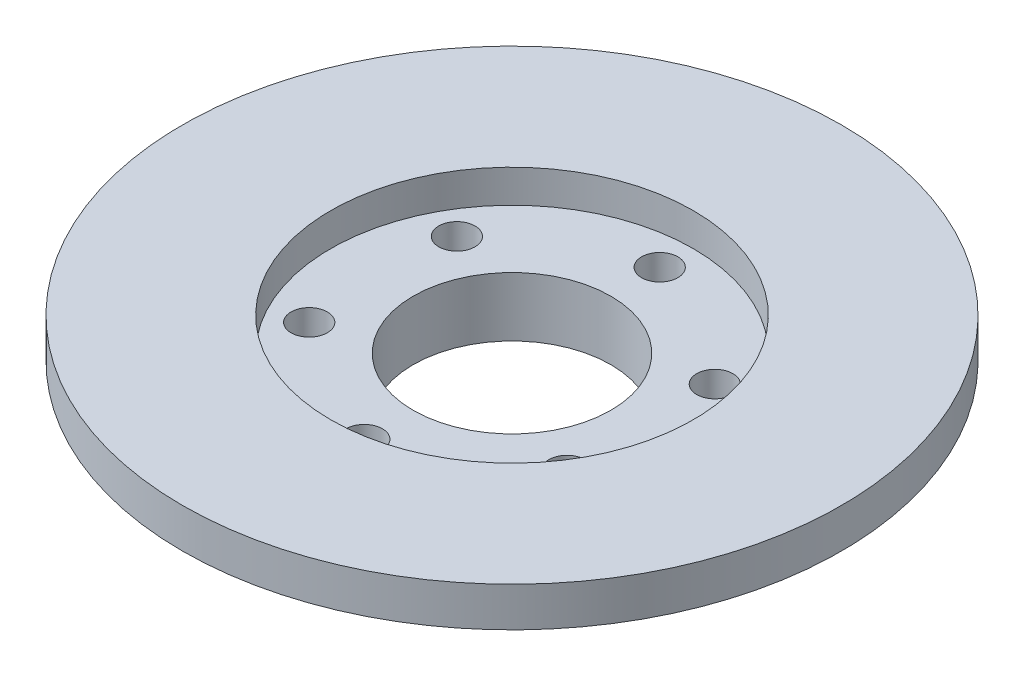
ISO-10303-21;
HEADER;
FILE_DESCRIPTION(('STEP AP214'),'2;1');
FILE_NAME('part.step','',(''),(''),'','','');
FILE_SCHEMA(('AUTOMOTIVE_DESIGN { 1 0 10303 214 1 1 1 1 }'));
ENDSEC;
DATA;
#1=APPLICATION_CONTEXT('core data for automotive mechanical design processes');
#2=APPLICATION_PROTOCOL_DEFINITION('international standard','automotive_design',2000,#1);
#3=PRODUCT_CONTEXT('',#1,'mechanical');
#4=PRODUCT('Part','Part','',(#3));
#5=PRODUCT_RELATED_PRODUCT_CATEGORY('part','',(#4));
#6=PRODUCT_DEFINITION_FORMATION('','',#4);
#7=PRODUCT_DEFINITION_CONTEXT('part definition',#1,'design');
#8=PRODUCT_DEFINITION('design','',#6,#7);
#9=PRODUCT_DEFINITION_SHAPE('','',#8);
#10=(LENGTH_UNIT() NAMED_UNIT(*) SI_UNIT(.MILLI.,.METRE.));
#11=(NAMED_UNIT(*) PLANE_ANGLE_UNIT() SI_UNIT($,.RADIAN.));
#12=(NAMED_UNIT(*) SI_UNIT($,.STERADIAN.) SOLID_ANGLE_UNIT());
#13=UNCERTAINTY_MEASURE_WITH_UNIT(LENGTH_MEASURE(1.E-05),#10,'distance_accuracy_value','');
#14=(GEOMETRIC_REPRESENTATION_CONTEXT(3) GLOBAL_UNCERTAINTY_ASSIGNED_CONTEXT((#13)) GLOBAL_UNIT_ASSIGNED_CONTEXT((#10,
#11,#12)) REPRESENTATION_CONTEXT('',''));
#15=CARTESIAN_POINT('',(0.,0.,0.));
#16=DIRECTION('',(0.,0.,1.));
#17=DIRECTION('',(1.,0.,0.));
#18=AXIS2_PLACEMENT_3D('',#15,#16,#17);
#19=CARTESIAN_POINT('',(0.779944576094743,-12.1504176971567,0.));
#20=DIRECTION('',(0.,-1.,0.));
#21=DIRECTION('',(0.,0.,-1.));
#22=AXIS2_PLACEMENT_3D('',#19,#20,#21);
#23=PLANE('',#22);
#24=CARTESIAN_POINT('',(-49.2200554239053,-12.1504176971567,0.));
#25=DIRECTION('',(0.,-1.,0.));
#26=DIRECTION('',(0.,0.,-1.));
#27=AXIS2_PLACEMENT_3D('',#24,#25,#26);
#28=CIRCLE('',#27,30.);
#29=CARTESIAN_POINT('',(-49.2200554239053,-12.1504176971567,-30.));
#30=VERTEX_POINT('',#29);
#31=EDGE_CURVE('E59',#30,#30,#28,.F.);
#32=ORIENTED_EDGE('',*,*,#31,.T.);
#33=EDGE_LOOP('',(#32));
#34=FACE_BOUND('',#33,.T.);
#35=CARTESIAN_POINT('',(-49.4013346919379,-12.1504176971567,-45.));
#36=DIRECTION('',(0.,-1.,0.));
#37=DIRECTION('',(0.,0.,-1.));
#38=AXIS2_PLACEMENT_3D('',#35,#36,#37);
#39=CIRCLE('',#38,5.5);
#40=CARTESIAN_POINT('',(-49.4013346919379,-12.1504176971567,-50.5));
#41=VERTEX_POINT('',#40);
#42=EDGE_CURVE('E62',#41,#41,#39,.F.);
#43=ORIENTED_EDGE('',*,*,#42,.T.);
#44=EDGE_LOOP('',(#43));
#45=FACE_BOUND('',#44,.T.);
#46=CARTESIAN_POINT('',(-88.2818382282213,-12.1504176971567,-22.3430075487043));
#47=DIRECTION('',(0.,-1.,0.));
#48=DIRECTION('',(0.,0.,-1.));
#49=AXIS2_PLACEMENT_3D('',#46,#47,#48);
#50=CIRCLE('',#49,5.50000000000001);
#51=CARTESIAN_POINT('',(-88.2818382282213,-12.1504176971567,-27.8430075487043));
#52=VERTEX_POINT('',#51);
#53=EDGE_CURVE('E65',#52,#52,#50,.F.);
#54=ORIENTED_EDGE('',*,*,#53,.T.);
#55=EDGE_LOOP('',(#54));
#56=FACE_BOUND('',#55,.T.);
#57=CARTESIAN_POINT('',(-10.3395518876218,-12.1504176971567,-22.6569924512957));
#58=DIRECTION('',(0.,-1.,0.));
#59=DIRECTION('',(1.,0.,0.));
#60=AXIS2_PLACEMENT_3D('',#57,#58,#59);
#61=CIRCLE('',#60,5.5);
#62=CARTESIAN_POINT('',(-4.83955188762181,-12.1504176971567,-22.6569924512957));
#63=VERTEX_POINT('',#62);
#64=EDGE_CURVE('E68',#63,#63,#61,.F.);
#65=ORIENTED_EDGE('',*,*,#64,.T.);
#66=EDGE_LOOP('',(#65));
#67=FACE_BOUND('',#66,.T.);
#68=CARTESIAN_POINT('',(-10.1582726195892,-12.1504176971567,22.3430075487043));
#69=DIRECTION('',(0.,-1.,0.));
#70=DIRECTION('',(0.,0.,-1.));
#71=AXIS2_PLACEMENT_3D('',#68,#69,#70);
#72=CIRCLE('',#71,5.5);
#73=CARTESIAN_POINT('',(-10.1582726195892,-12.1504176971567,16.8430075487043));
#74=VERTEX_POINT('',#73);
#75=EDGE_CURVE('E71',#74,#74,#72,.F.);
#76=ORIENTED_EDGE('',*,*,#75,.T.);
#77=EDGE_LOOP('',(#76));
#78=FACE_BOUND('',#77,.T.);
#79=CARTESIAN_POINT('',(-49.0387761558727,-12.1504176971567,45.));
#80=DIRECTION('',(0.,-1.,0.));
#81=DIRECTION('',(0.,0.,-1.));
#82=AXIS2_PLACEMENT_3D('',#79,#80,#81);
#83=CIRCLE('',#82,5.5);
#84=CARTESIAN_POINT('',(-49.0387761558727,-12.1504176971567,39.5));
#85=VERTEX_POINT('',#84);
#86=EDGE_CURVE('E74',#85,#85,#83,.F.);
#87=ORIENTED_EDGE('',*,*,#86,.T.);
#88=EDGE_LOOP('',(#87));
#89=FACE_BOUND('',#88,.T.);
#90=CARTESIAN_POINT('',(-88.1005589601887,-12.1504176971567,22.6569924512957));
#91=DIRECTION('',(0.,-1.,0.));
#92=DIRECTION('',(1.,0.,0.));
#93=AXIS2_PLACEMENT_3D('',#90,#91,#92);
#94=CIRCLE('',#93,5.5);
#95=CARTESIAN_POINT('',(-82.6005589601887,-12.1504176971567,22.6569924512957));
#96=VERTEX_POINT('',#95);
#97=EDGE_CURVE('E76',#96,#96,#94,.F.);
#98=ORIENTED_EDGE('',*,*,#97,.T.);
#99=EDGE_LOOP('',(#98));
#100=FACE_BOUND('',#99,.T.);
#101=CARTESIAN_POINT('',(-49.2200554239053,-12.1504176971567,0.));
#102=DIRECTION('',(0.,-1.,0.));
#103=DIRECTION('',(0.,0.,-1.));
#104=AXIS2_PLACEMENT_3D('',#101,#102,#103);
#105=CIRCLE('',#104,70.);
#106=CARTESIAN_POINT('',(-49.2200554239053,-12.1504176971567,-70.));
#107=VERTEX_POINT('',#106);
#108=EDGE_CURVE('E18',#107,#107,#105,.F.);
#109=ORIENTED_EDGE('',*,*,#108,.F.);
#110=EDGE_LOOP('',(#109));
#111=FACE_BOUND('',#110,.T.);
#112=ADVANCED_FACE('F14',(#34,#45,#56,#67,#78,#89,#100,#111),#23,.T.);
#113=CARTESIAN_POINT('',(-49.2200554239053,-4.15041769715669,0.));
#114=DIRECTION('',(0.,-1.,0.));
#115=DIRECTION('',(0.,0.,-1.));
#116=AXIS2_PLACEMENT_3D('',#113,#114,#115);
#117=CYLINDRICAL_SURFACE('',#116,70.);
#118=ORIENTED_EDGE('',*,*,#108,.T.);
#119=EDGE_LOOP('',(#118));
#120=FACE_BOUND('',#119,.T.);
#121=CARTESIAN_POINT('',(-49.2200554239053,3.84958230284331,0.));
#122=DIRECTION('',(0.,-1.,0.));
#123=DIRECTION('',(0.,0.,-1.));
#124=AXIS2_PLACEMENT_3D('',#121,#122,#123);
#125=CIRCLE('',#124,70.);
#126=CARTESIAN_POINT('',(-49.2200554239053,3.84958230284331,-70.));
#127=VERTEX_POINT('',#126);
#128=EDGE_CURVE('E56',#127,#127,#125,.F.);
#129=ORIENTED_EDGE('',*,*,#128,.F.);
#130=EDGE_LOOP('',(#129));
#131=FACE_BOUND('',#130,.T.);
#132=ADVANCED_FACE('F83',(#120,#131),#117,.T.);
#133=CARTESIAN_POINT('',(-88.1005589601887,5.84958230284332,22.6569924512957));
#134=DIRECTION('',(0.,-1.,0.));
#135=DIRECTION('',(1.,0.,0.));
#136=AXIS2_PLACEMENT_3D('',#133,#134,#135);
#137=CYLINDRICAL_SURFACE('',#136,5.5);
#138=CARTESIAN_POINT('',(-88.1005589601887,5.8495823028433,22.6569924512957));
#139=DIRECTION('',(0.,-1.,0.));
#140=DIRECTION('',(1.,0.,0.));
#141=AXIS2_PLACEMENT_3D('',#138,#139,#140);
#142=CIRCLE('',#141,5.5);
#143=CARTESIAN_POINT('',(-82.6005589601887,5.8495823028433,22.6569924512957));
#144=VERTEX_POINT('',#143);
#145=EDGE_CURVE('E53',#144,#144,#142,.T.);
#146=ORIENTED_EDGE('',*,*,#145,.F.);
#147=EDGE_LOOP('',(#146));
#148=FACE_BOUND('',#147,.T.);
#149=ORIENTED_EDGE('',*,*,#97,.F.);
#150=EDGE_LOOP('',(#149));
#151=FACE_BOUND('',#150,.T.);
#152=ADVANCED_FACE('F92',(#148,#151),#137,.F.);
#153=CARTESIAN_POINT('',(-49.0387761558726,5.84958230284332,45.));
#154=DIRECTION('',(0.,-1.,0.));
#155=DIRECTION('',(0.,0.,-1.));
#156=AXIS2_PLACEMENT_3D('',#153,#154,#155);
#157=CYLINDRICAL_SURFACE('',#156,5.5);
#158=CARTESIAN_POINT('',(-49.0387761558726,5.8495823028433,45.));
#159=DIRECTION('',(0.,-1.,0.));
#160=DIRECTION('',(0.,0.,-1.));
#161=AXIS2_PLACEMENT_3D('',#158,#159,#160);
#162=CIRCLE('',#161,5.5);
#163=CARTESIAN_POINT('',(-49.0387761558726,5.8495823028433,39.5));
#164=VERTEX_POINT('',#163);
#165=EDGE_CURVE('E50',#164,#164,#162,.T.);
#166=ORIENTED_EDGE('',*,*,#165,.F.);
#167=EDGE_LOOP('',(#166));
#168=FACE_BOUND('',#167,.T.);
#169=ORIENTED_EDGE('',*,*,#86,.F.);
#170=EDGE_LOOP('',(#169));
#171=FACE_BOUND('',#170,.T.);
#172=ADVANCED_FACE('F109',(#168,#171),#157,.F.);
#173=CARTESIAN_POINT('',(-10.1582726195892,5.84958230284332,22.3430075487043));
#174=DIRECTION('',(0.,-1.,0.));
#175=DIRECTION('',(0.,0.,-1.));
#176=AXIS2_PLACEMENT_3D('',#173,#174,#175);
#177=CYLINDRICAL_SURFACE('',#176,5.5);
#178=CARTESIAN_POINT('',(-10.1582726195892,5.8495823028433,22.3430075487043));
#179=DIRECTION('',(0.,-1.,0.));
#180=DIRECTION('',(0.,0.,-1.));
#181=AXIS2_PLACEMENT_3D('',#178,#179,#180);
#182=CIRCLE('',#181,5.5);
#183=CARTESIAN_POINT('',(-10.1582726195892,5.8495823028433,16.8430075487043));
#184=VERTEX_POINT('',#183);
#185=EDGE_CURVE('E47',#184,#184,#182,.T.);
#186=ORIENTED_EDGE('',*,*,#185,.F.);
#187=EDGE_LOOP('',(#186));
#188=FACE_BOUND('',#187,.T.);
#189=ORIENTED_EDGE('',*,*,#75,.F.);
#190=EDGE_LOOP('',(#189));
#191=FACE_BOUND('',#190,.T.);
#192=ADVANCED_FACE('F113',(#188,#191),#177,.F.);
#193=CARTESIAN_POINT('',(-10.3395518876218,5.84958230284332,-22.6569924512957));
#194=DIRECTION('',(0.,-1.,0.));
#195=DIRECTION('',(1.,0.,0.));
#196=AXIS2_PLACEMENT_3D('',#193,#194,#195);
#197=CYLINDRICAL_SURFACE('',#196,5.5);
#198=CARTESIAN_POINT('',(-10.3395518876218,5.8495823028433,-22.6569924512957));
#199=DIRECTION('',(0.,-1.,0.));
#200=DIRECTION('',(1.,0.,0.));
#201=AXIS2_PLACEMENT_3D('',#198,#199,#200);
#202=CIRCLE('',#201,5.5);
#203=CARTESIAN_POINT('',(-4.83955188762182,5.8495823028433,-22.6569924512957));
#204=VERTEX_POINT('',#203);
#205=EDGE_CURVE('E44',#204,#204,#202,.T.);
#206=ORIENTED_EDGE('',*,*,#205,.F.);
#207=EDGE_LOOP('',(#206));
#208=FACE_BOUND('',#207,.T.);
#209=ORIENTED_EDGE('',*,*,#64,.F.);
#210=EDGE_LOOP('',(#209));
#211=FACE_BOUND('',#210,.T.);
#212=ADVANCED_FACE('F117',(#208,#211),#197,.F.);
#213=CARTESIAN_POINT('',(-88.2818382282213,5.84958230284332,-22.3430075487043));
#214=DIRECTION('',(0.,-1.,0.));
#215=DIRECTION('',(0.,0.,-1.));
#216=AXIS2_PLACEMENT_3D('',#213,#214,#215);
#217=CYLINDRICAL_SURFACE('',#216,5.50000000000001);
#218=CARTESIAN_POINT('',(-88.2818382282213,5.8495823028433,-22.3430075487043));
#219=DIRECTION('',(0.,-1.,0.));
#220=DIRECTION('',(0.,0.,-1.));
#221=AXIS2_PLACEMENT_3D('',#218,#219,#220);
#222=CIRCLE('',#221,5.50000000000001);
#223=CARTESIAN_POINT('',(-88.2818382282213,5.8495823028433,-27.8430075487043));
#224=VERTEX_POINT('',#223);
#225=EDGE_CURVE('E41',#224,#224,#222,.T.);
#226=ORIENTED_EDGE('',*,*,#225,.F.);
#227=EDGE_LOOP('',(#226));
#228=FACE_BOUND('',#227,.T.);
#229=ORIENTED_EDGE('',*,*,#53,.F.);
#230=EDGE_LOOP('',(#229));
#231=FACE_BOUND('',#230,.T.);
#232=ADVANCED_FACE('F120',(#228,#231),#217,.F.);
#233=CARTESIAN_POINT('',(-49.4013346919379,5.84958230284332,-45.));
#234=DIRECTION('',(0.,-1.,0.));
#235=DIRECTION('',(0.,0.,-1.));
#236=AXIS2_PLACEMENT_3D('',#233,#234,#235);
#237=CYLINDRICAL_SURFACE('',#236,5.5);
#238=CARTESIAN_POINT('',(-49.4013346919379,5.8495823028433,-45.));
#239=DIRECTION('',(0.,-1.,0.));
#240=DIRECTION('',(0.,0.,-1.));
#241=AXIS2_PLACEMENT_3D('',#238,#239,#240);
#242=CIRCLE('',#241,5.5);
#243=CARTESIAN_POINT('',(-49.4013346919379,5.8495823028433,-50.5));
#244=VERTEX_POINT('',#243);
#245=EDGE_CURVE('E38',#244,#244,#242,.T.);
#246=ORIENTED_EDGE('',*,*,#245,.F.);
#247=EDGE_LOOP('',(#246));
#248=FACE_BOUND('',#247,.T.);
#249=ORIENTED_EDGE('',*,*,#42,.F.);
#250=EDGE_LOOP('',(#249));
#251=FACE_BOUND('',#250,.T.);
#252=ADVANCED_FACE('F16',(#248,#251),#237,.F.);
#253=CARTESIAN_POINT('',(-49.2200554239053,-3.1504176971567,0.));
#254=DIRECTION('',(0.,-1.,0.));
#255=DIRECTION('',(0.,0.,-1.));
#256=AXIS2_PLACEMENT_3D('',#253,#254,#255);
#257=CYLINDRICAL_SURFACE('',#256,30.);
#258=CARTESIAN_POINT('',(-49.2200554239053,5.8495823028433,0.));
#259=DIRECTION('',(0.,-1.,0.));
#260=DIRECTION('',(0.,0.,-1.));
#261=AXIS2_PLACEMENT_3D('',#258,#259,#260);
#262=CIRCLE('',#261,30.);
#263=CARTESIAN_POINT('',(-49.2200554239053,5.8495823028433,-30.));
#264=VERTEX_POINT('',#263);
#265=EDGE_CURVE('E35',#264,#264,#262,.T.);
#266=ORIENTED_EDGE('',*,*,#265,.F.);
#267=EDGE_LOOP('',(#266));
#268=FACE_BOUND('',#267,.T.);
#269=ORIENTED_EDGE('',*,*,#31,.F.);
#270=EDGE_LOOP('',(#269));
#271=FACE_BOUND('',#270,.T.);
#272=ADVANCED_FACE('F126',(#268,#271),#257,.F.);
#273=CARTESIAN_POINT('',(35.7799445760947,3.84958230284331,0.));
#274=DIRECTION('',(0.,-1.,0.));
#275=DIRECTION('',(0.,0.,-1.));
#276=AXIS2_PLACEMENT_3D('',#273,#274,#275);
#277=PLANE('',#276);
#278=ORIENTED_EDGE('',*,*,#128,.T.);
#279=EDGE_LOOP('',(#278));
#280=FACE_BOUND('',#279,.T.);
#281=CARTESIAN_POINT('',(-49.2200554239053,3.84958230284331,0.));
#282=DIRECTION('',(0.,-1.,0.));
#283=DIRECTION('',(0.,0.,-1.));
#284=AXIS2_PLACEMENT_3D('',#281,#282,#283);
#285=CIRCLE('',#284,100.);
#286=CARTESIAN_POINT('',(-49.2200554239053,3.84958230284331,-100.));
#287=VERTEX_POINT('',#286);
#288=EDGE_CURVE('E32',#287,#287,#285,.F.);
#289=ORIENTED_EDGE('',*,*,#288,.F.);
#290=EDGE_LOOP('',(#289));
#291=FACE_BOUND('',#290,.T.);
#292=ADVANCED_FACE('F145',(#280,#291),#277,.T.);
#293=CARTESIAN_POINT('',(-6.72005542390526,5.8495823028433,0.));
#294=DIRECTION('',(0.,1.,0.));
#295=DIRECTION('',(0.,0.,1.));
#296=AXIS2_PLACEMENT_3D('',#293,#294,#295);
#297=PLANE('',#296);
#298=ORIENTED_EDGE('',*,*,#265,.T.);
#299=EDGE_LOOP('',(#298));
#300=FACE_BOUND('',#299,.T.);
#301=ORIENTED_EDGE('',*,*,#245,.T.);
#302=EDGE_LOOP('',(#301));
#303=FACE_BOUND('',#302,.T.);
#304=ORIENTED_EDGE('',*,*,#225,.T.);
#305=EDGE_LOOP('',(#304));
#306=FACE_BOUND('',#305,.T.);
#307=ORIENTED_EDGE('',*,*,#205,.T.);
#308=EDGE_LOOP('',(#307));
#309=FACE_BOUND('',#308,.T.);
#310=ORIENTED_EDGE('',*,*,#185,.T.);
#311=EDGE_LOOP('',(#310));
#312=FACE_BOUND('',#311,.T.);
#313=ORIENTED_EDGE('',*,*,#165,.T.);
#314=EDGE_LOOP('',(#313));
#315=FACE_BOUND('',#314,.T.);
#316=ORIENTED_EDGE('',*,*,#145,.T.);
#317=EDGE_LOOP('',(#316));
#318=FACE_BOUND('',#317,.T.);
#319=CARTESIAN_POINT('',(-49.2200554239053,5.84958230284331,0.));
#320=DIRECTION('',(0.,-1.,0.));
#321=DIRECTION('',(0.,0.,-1.));
#322=AXIS2_PLACEMENT_3D('',#319,#320,#321);
#323=CIRCLE('',#322,55.);
#324=CARTESIAN_POINT('',(-49.2200554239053,5.84958230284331,-55.));
#325=VERTEX_POINT('',#324);
#326=EDGE_CURVE('E27',#325,#325,#323,.F.);
#327=ORIENTED_EDGE('',*,*,#326,.T.);
#328=EDGE_LOOP('',(#327));
#329=FACE_BOUND('',#328,.T.);
#330=ADVANCED_FACE('F142',(#300,#303,#306,#309,#312,#315,#318,#329),#297,.T.);
#331=CARTESIAN_POINT('',(-49.2200554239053,9.84958230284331,0.));
#332=DIRECTION('',(0.,-1.,0.));
#333=DIRECTION('',(0.,0.,-1.));
#334=AXIS2_PLACEMENT_3D('',#331,#332,#333);
#335=CYLINDRICAL_SURFACE('',#334,100.);
#336=ORIENTED_EDGE('',*,*,#288,.T.);
#337=EDGE_LOOP('',(#336));
#338=FACE_BOUND('',#337,.T.);
#339=CARTESIAN_POINT('',(-49.2200554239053,15.8495823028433,0.));
#340=DIRECTION('',(0.,-1.,0.));
#341=DIRECTION('',(0.,0.,-1.));
#342=AXIS2_PLACEMENT_3D('',#339,#340,#341);
#343=CIRCLE('',#342,100.);
#344=CARTESIAN_POINT('',(-49.2200554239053,15.8495823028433,-100.));
#345=VERTEX_POINT('',#344);
#346=EDGE_CURVE('E22',#345,#345,#343,.F.);
#347=ORIENTED_EDGE('',*,*,#346,.F.);
#348=EDGE_LOOP('',(#347));
#349=FACE_BOUND('',#348,.T.);
#350=ADVANCED_FACE('F101',(#338,#349),#335,.T.);
#351=CARTESIAN_POINT('',(-49.2200554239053,10.8495823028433,0.));
#352=DIRECTION('',(0.,-1.,0.));
#353=DIRECTION('',(0.,0.,-1.));
#354=AXIS2_PLACEMENT_3D('',#351,#352,#353);
#355=CYLINDRICAL_SURFACE('',#354,55.);
#356=CARTESIAN_POINT('',(-49.2200554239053,15.8495823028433,0.));
#357=DIRECTION('',(0.,-1.,0.));
#358=DIRECTION('',(0.,0.,-1.));
#359=AXIS2_PLACEMENT_3D('',#356,#357,#358);
#360=CIRCLE('',#359,55.);
#361=CARTESIAN_POINT('',(-49.2200554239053,15.8495823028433,-55.));
#362=VERTEX_POINT('',#361);
#363=EDGE_CURVE('E9',#362,#362,#360,.T.);
#364=ORIENTED_EDGE('',*,*,#363,.F.);
#365=EDGE_LOOP('',(#364));
#366=FACE_BOUND('',#365,.T.);
#367=ORIENTED_EDGE('',*,*,#326,.F.);
#368=EDGE_LOOP('',(#367));
#369=FACE_BOUND('',#368,.T.);
#370=ADVANCED_FACE('F97',(#366,#369),#355,.F.);
#371=CARTESIAN_POINT('',(28.2799445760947,15.8495823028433,0.));
#372=DIRECTION('',(0.,1.,0.));
#373=DIRECTION('',(0.,0.,1.));
#374=AXIS2_PLACEMENT_3D('',#371,#372,#373);
#375=PLANE('',#374);
#376=ORIENTED_EDGE('',*,*,#363,.T.);
#377=EDGE_LOOP('',(#376));
#378=FACE_BOUND('',#377,.T.);
#379=ORIENTED_EDGE('',*,*,#346,.T.);
#380=EDGE_LOOP('',(#379));
#381=FACE_BOUND('',#380,.T.);
#382=ADVANCED_FACE('F95',(#378,#381),#375,.T.);
#383=CLOSED_SHELL('',(#112,#132,#152,#172,#192,#212,#232,#252,#272,#292,#330,#350,#370,#382));
#384=MANIFOLD_SOLID_BREP('B1',#383);
#385=ADVANCED_BREP_SHAPE_REPRESENTATION('',(#18,#384),#14);
#386=SHAPE_DEFINITION_REPRESENTATION(#9,#385);
ENDSEC;
END-ISO-10303-21;
